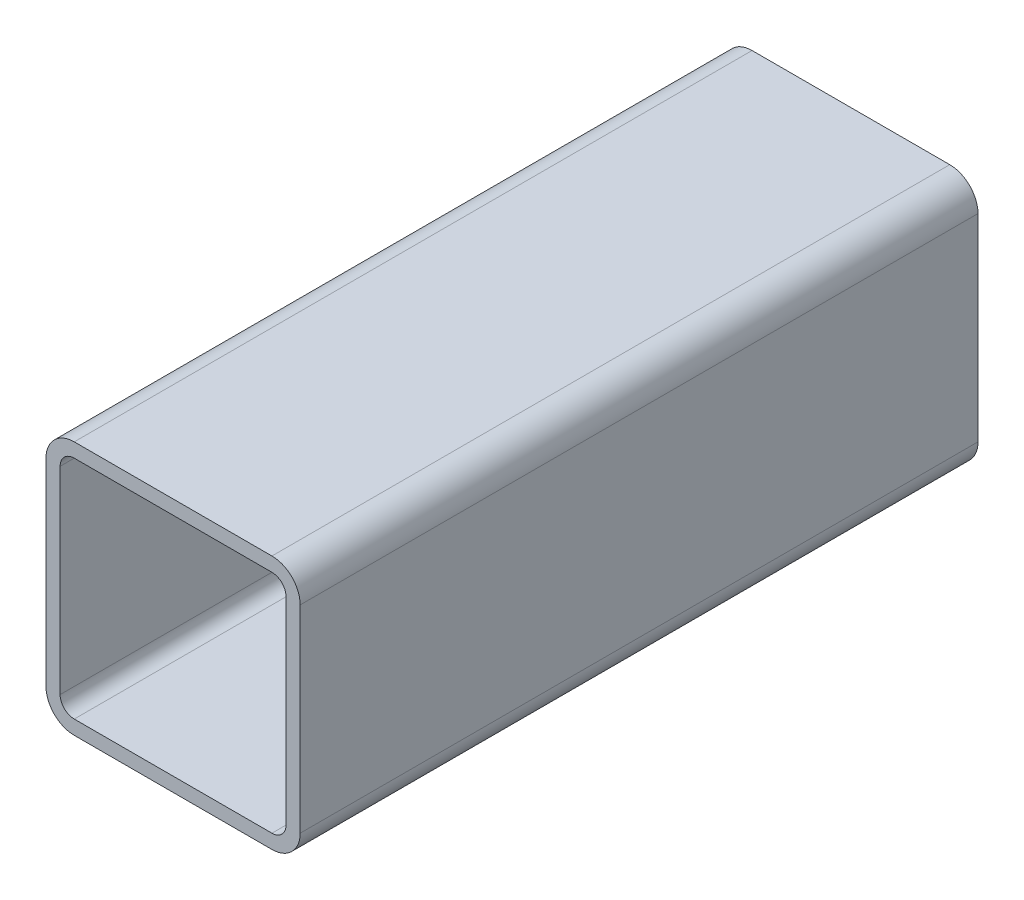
ISO-10303-21;
HEADER;
FILE_DESCRIPTION(('STEP AP214'),'2;1');
FILE_NAME('part.step','',(''),(''),'','','');
FILE_SCHEMA(('AUTOMOTIVE_DESIGN { 1 0 10303 214 1 1 1 1 }'));
ENDSEC;
DATA;
#1=APPLICATION_CONTEXT('core data for automotive mechanical design processes');
#2=APPLICATION_PROTOCOL_DEFINITION('international standard','automotive_design',2000,#1);
#3=PRODUCT_CONTEXT('',#1,'mechanical');
#4=PRODUCT('Part','Part','',(#3));
#5=PRODUCT_RELATED_PRODUCT_CATEGORY('part','',(#4));
#6=PRODUCT_DEFINITION_FORMATION('','',#4);
#7=PRODUCT_DEFINITION_CONTEXT('part definition',#1,'design');
#8=PRODUCT_DEFINITION('design','',#6,#7);
#9=PRODUCT_DEFINITION_SHAPE('','',#8);
#10=(LENGTH_UNIT() NAMED_UNIT(*) SI_UNIT(.MILLI.,.METRE.));
#11=(NAMED_UNIT(*) PLANE_ANGLE_UNIT() SI_UNIT($,.RADIAN.));
#12=(NAMED_UNIT(*) SI_UNIT($,.STERADIAN.) SOLID_ANGLE_UNIT());
#13=UNCERTAINTY_MEASURE_WITH_UNIT(LENGTH_MEASURE(1.E-05),#10,'distance_accuracy_value','');
#14=(GEOMETRIC_REPRESENTATION_CONTEXT(3) GLOBAL_UNCERTAINTY_ASSIGNED_CONTEXT((#13)) GLOBAL_UNIT_ASSIGNED_CONTEXT((#10,
#11,#12)) REPRESENTATION_CONTEXT('',''));
#15=CARTESIAN_POINT('',(0.,0.,0.));
#16=DIRECTION('',(0.,0.,1.));
#17=DIRECTION('',(1.,0.,0.));
#18=AXIS2_PLACEMENT_3D('',#15,#16,#17);
#19=CARTESIAN_POINT('',(13.9682087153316,102.378601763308,304.8));
#20=DIRECTION('',(0.,0.,1.));
#21=DIRECTION('',(1.,0.,0.));
#22=AXIS2_PLACEMENT_3D('',#19,#20,#21);
#23=PLANE('',#22);
#24=CARTESIAN_POINT('',(13.9682087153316,102.378601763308,304.8));
#25=DIRECTION('',(0.,0.,1.));
#26=DIRECTION('',(1.,0.,0.));
#27=AXIS2_PLACEMENT_3D('',#24,#25,#26);
#28=CIRCLE('',#27,12.7);
#29=CARTESIAN_POINT('',(13.9682087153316,115.078601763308,304.8));
#30=VERTEX_POINT('',#29);
#31=CARTESIAN_POINT('',(1.26820871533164,102.378601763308,304.8));
#32=VERTEX_POINT('',#31);
#33=EDGE_CURVE('E211',#30,#32,#28,.T.);
#34=ORIENTED_EDGE('',*,*,#33,.T.);
#35=DIRECTION('',(0.,-1.,0.));
#36=VECTOR('',#35,1.);
#37=CARTESIAN_POINT('',(1.26820871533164,13.4786017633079,304.8));
#38=LINE('',#37,#36);
#39=CARTESIAN_POINT('',(1.26820871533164,13.4786017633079,304.8));
#40=VERTEX_POINT('',#39);
#41=EDGE_CURVE('E214',#32,#40,#38,.T.);
#42=ORIENTED_EDGE('',*,*,#41,.T.);
#43=CARTESIAN_POINT('',(13.9682087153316,13.4786017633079,304.8));
#44=DIRECTION('',(0.,0.,1.));
#45=DIRECTION('',(1.,0.,0.));
#46=AXIS2_PLACEMENT_3D('',#43,#44,#45);
#47=CIRCLE('',#46,12.7);
#48=CARTESIAN_POINT('',(13.9682087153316,0.77860176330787,304.8));
#49=VERTEX_POINT('',#48);
#50=EDGE_CURVE('E217',#40,#49,#47,.T.);
#51=ORIENTED_EDGE('',*,*,#50,.T.);
#52=DIRECTION('',(1.,0.,0.));
#53=VECTOR('',#52,1.);
#54=CARTESIAN_POINT('',(102.868208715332,0.77860176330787,304.8));
#55=LINE('',#54,#53);
#56=CARTESIAN_POINT('',(102.868208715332,0.778601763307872,304.8));
#57=VERTEX_POINT('',#56);
#58=EDGE_CURVE('E219',#49,#57,#55,.T.);
#59=ORIENTED_EDGE('',*,*,#58,.T.);
#60=CARTESIAN_POINT('',(102.868208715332,13.4786017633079,304.8));
#61=DIRECTION('',(0.,0.,1.));
#62=DIRECTION('',(1.,0.,0.));
#63=AXIS2_PLACEMENT_3D('',#60,#61,#62);
#64=CIRCLE('',#63,12.7);
#65=CARTESIAN_POINT('',(115.568208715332,13.4786017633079,304.8));
#66=VERTEX_POINT('',#65);
#67=EDGE_CURVE('E221',#57,#66,#64,.T.);
#68=ORIENTED_EDGE('',*,*,#67,.T.);
#69=DIRECTION('',(0.,1.,0.));
#70=VECTOR('',#69,1.);
#71=CARTESIAN_POINT('',(115.568208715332,102.378601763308,304.8));
#72=LINE('',#71,#70);
#73=CARTESIAN_POINT('',(115.568208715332,102.378601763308,304.8));
#74=VERTEX_POINT('',#73);
#75=EDGE_CURVE('E223',#66,#74,#72,.T.);
#76=ORIENTED_EDGE('',*,*,#75,.T.);
#77=CARTESIAN_POINT('',(102.868208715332,102.378601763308,304.8));
#78=DIRECTION('',(0.,0.,1.));
#79=DIRECTION('',(1.,0.,0.));
#80=AXIS2_PLACEMENT_3D('',#77,#78,#79);
#81=CIRCLE('',#80,12.7);
#82=CARTESIAN_POINT('',(102.868208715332,115.078601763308,304.8));
#83=VERTEX_POINT('',#82);
#84=EDGE_CURVE('E225',#74,#83,#81,.T.);
#85=ORIENTED_EDGE('',*,*,#84,.T.);
#86=DIRECTION('',(-1.,0.,0.));
#87=VECTOR('',#86,1.);
#88=CARTESIAN_POINT('',(13.9682087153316,115.078601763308,304.8));
#89=LINE('',#88,#87);
#90=EDGE_CURVE('E227',#83,#30,#89,.T.);
#91=ORIENTED_EDGE('',*,*,#90,.T.);
#92=EDGE_LOOP('',(#34,#42,#51,#59,#68,#76,#85,#91));
#93=FACE_BOUND('',#92,.T.);
#94=DIRECTION('',(0.,-1.,0.));
#95=VECTOR('',#94,1.);
#96=CARTESIAN_POINT('',(7.61820871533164,13.4786017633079,304.8));
#97=LINE('',#96,#95);
#98=CARTESIAN_POINT('',(7.61820871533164,102.378601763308,304.8));
#99=VERTEX_POINT('',#98);
#100=CARTESIAN_POINT('',(7.61820871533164,13.4786017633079,304.8));
#101=VERTEX_POINT('',#100);
#102=EDGE_CURVE('E154',#99,#101,#97,.T.);
#103=ORIENTED_EDGE('',*,*,#102,.F.);
#104=CARTESIAN_POINT('',(13.9682087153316,102.378601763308,304.8));
#105=DIRECTION('',(0.,0.,1.));
#106=DIRECTION('',(1.,0.,0.));
#107=AXIS2_PLACEMENT_3D('',#104,#105,#106);
#108=CIRCLE('',#107,6.35000000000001);
#109=CARTESIAN_POINT('',(13.9682087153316,108.728601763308,304.8));
#110=VERTEX_POINT('',#109);
#111=EDGE_CURVE('E146',#110,#99,#108,.T.);
#112=ORIENTED_EDGE('',*,*,#111,.F.);
#113=DIRECTION('',(-1.,0.,0.));
#114=VECTOR('',#113,1.);
#115=CARTESIAN_POINT('',(13.9682087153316,108.728601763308,304.8));
#116=LINE('',#115,#114);
#117=CARTESIAN_POINT('',(102.868208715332,108.728601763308,304.8));
#118=VERTEX_POINT('',#117);
#119=EDGE_CURVE('E179',#118,#110,#116,.T.);
#120=ORIENTED_EDGE('',*,*,#119,.F.);
#121=CARTESIAN_POINT('',(102.868208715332,102.378601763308,304.8));
#122=DIRECTION('',(0.,0.,1.));
#123=DIRECTION('',(1.,0.,0.));
#124=AXIS2_PLACEMENT_3D('',#121,#122,#123);
#125=CIRCLE('',#124,6.35000000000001);
#126=CARTESIAN_POINT('',(109.218208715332,102.378601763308,304.8));
#127=VERTEX_POINT('',#126);
#128=EDGE_CURVE('E177',#127,#118,#125,.T.);
#129=ORIENTED_EDGE('',*,*,#128,.F.);
#130=DIRECTION('',(0.,1.,0.));
#131=VECTOR('',#130,1.);
#132=CARTESIAN_POINT('',(109.218208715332,102.378601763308,304.8));
#133=LINE('',#132,#131);
#134=CARTESIAN_POINT('',(109.218208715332,13.4786017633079,304.8));
#135=VERTEX_POINT('',#134);
#136=EDGE_CURVE('E175',#135,#127,#133,.T.);
#137=ORIENTED_EDGE('',*,*,#136,.F.);
#138=CARTESIAN_POINT('',(102.868208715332,13.4786017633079,304.8));
#139=DIRECTION('',(0.,0.,1.));
#140=DIRECTION('',(1.,0.,0.));
#141=AXIS2_PLACEMENT_3D('',#138,#139,#140);
#142=CIRCLE('',#141,6.35);
#143=CARTESIAN_POINT('',(102.868208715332,7.12860176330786,304.8));
#144=VERTEX_POINT('',#143);
#145=EDGE_CURVE('E173',#144,#135,#142,.T.);
#146=ORIENTED_EDGE('',*,*,#145,.F.);
#147=DIRECTION('',(1.,0.,0.));
#148=VECTOR('',#147,1.);
#149=CARTESIAN_POINT('',(102.868208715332,7.12860176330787,304.8));
#150=LINE('',#149,#148);
#151=CARTESIAN_POINT('',(13.9682087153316,7.12860176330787,304.8));
#152=VERTEX_POINT('',#151);
#153=EDGE_CURVE('E169',#152,#144,#150,.T.);
#154=ORIENTED_EDGE('',*,*,#153,.F.);
#155=CARTESIAN_POINT('',(13.9682087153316,13.4786017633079,304.8));
#156=DIRECTION('',(0.,0.,1.));
#157=DIRECTION('',(1.,0.,0.));
#158=AXIS2_PLACEMENT_3D('',#155,#156,#157);
#159=CIRCLE('',#158,6.35);
#160=EDGE_CURVE('E167',#101,#152,#159,.T.);
#161=ORIENTED_EDGE('',*,*,#160,.F.);
#162=EDGE_LOOP('',(#103,#112,#120,#129,#137,#146,#154,#161));
#163=FACE_BOUND('',#162,.T.);
#164=ADVANCED_FACE('F33',(#93,#163),#23,.T.);
#165=CARTESIAN_POINT('',(13.9682087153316,102.378601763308,0.));
#166=DIRECTION('',(0.,0.,1.));
#167=DIRECTION('',(1.,0.,0.));
#168=AXIS2_PLACEMENT_3D('',#165,#166,#167);
#169=PLANE('',#168);
#170=CARTESIAN_POINT('',(13.9682087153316,102.378601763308,0.));
#171=DIRECTION('',(0.,0.,1.));
#172=DIRECTION('',(1.,0.,0.));
#173=AXIS2_PLACEMENT_3D('',#170,#171,#172);
#174=CIRCLE('',#173,12.7);
#175=CARTESIAN_POINT('',(13.9682087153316,115.078601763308,0.));
#176=VERTEX_POINT('',#175);
#177=CARTESIAN_POINT('',(1.26820871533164,102.378601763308,0.));
#178=VERTEX_POINT('',#177);
#179=EDGE_CURVE('E162',#176,#178,#174,.T.);
#180=ORIENTED_EDGE('',*,*,#179,.F.);
#181=DIRECTION('',(-1.,0.,0.));
#182=VECTOR('',#181,1.);
#183=CARTESIAN_POINT('',(13.9682087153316,115.078601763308,0.));
#184=LINE('',#183,#182);
#185=CARTESIAN_POINT('',(102.868208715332,115.078601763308,0.));
#186=VERTEX_POINT('',#185);
#187=EDGE_CURVE('E215',#186,#176,#184,.T.);
#188=ORIENTED_EDGE('',*,*,#187,.F.);
#189=CARTESIAN_POINT('',(102.868208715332,102.378601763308,0.));
#190=DIRECTION('',(0.,0.,1.));
#191=DIRECTION('',(1.,0.,0.));
#192=AXIS2_PLACEMENT_3D('',#189,#190,#191);
#193=CIRCLE('',#192,12.7);
#194=CARTESIAN_POINT('',(115.568208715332,102.378601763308,0.));
#195=VERTEX_POINT('',#194);
#196=EDGE_CURVE('E242',#195,#186,#193,.T.);
#197=ORIENTED_EDGE('',*,*,#196,.F.);
#198=DIRECTION('',(0.,1.,0.));
#199=VECTOR('',#198,1.);
#200=CARTESIAN_POINT('',(115.568208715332,102.378601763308,0.));
#201=LINE('',#200,#199);
#202=CARTESIAN_POINT('',(115.568208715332,13.4786017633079,0.));
#203=VERTEX_POINT('',#202);
#204=EDGE_CURVE('E240',#203,#195,#201,.T.);
#205=ORIENTED_EDGE('',*,*,#204,.F.);
#206=CARTESIAN_POINT('',(102.868208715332,13.4786017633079,0.));
#207=DIRECTION('',(0.,0.,1.));
#208=DIRECTION('',(1.,0.,0.));
#209=AXIS2_PLACEMENT_3D('',#206,#207,#208);
#210=CIRCLE('',#209,12.7);
#211=CARTESIAN_POINT('',(102.868208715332,0.778601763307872,0.));
#212=VERTEX_POINT('',#211);
#213=EDGE_CURVE('E238',#212,#203,#210,.T.);
#214=ORIENTED_EDGE('',*,*,#213,.F.);
#215=DIRECTION('',(1.,0.,0.));
#216=VECTOR('',#215,1.);
#217=CARTESIAN_POINT('',(102.868208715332,0.77860176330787,0.));
#218=LINE('',#217,#216);
#219=CARTESIAN_POINT('',(13.9682087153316,0.77860176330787,0.));
#220=VERTEX_POINT('',#219);
#221=EDGE_CURVE('E236',#220,#212,#218,.T.);
#222=ORIENTED_EDGE('',*,*,#221,.F.);
#223=CARTESIAN_POINT('',(13.9682087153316,13.4786017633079,0.));
#224=DIRECTION('',(0.,0.,1.));
#225=DIRECTION('',(1.,0.,0.));
#226=AXIS2_PLACEMENT_3D('',#223,#224,#225);
#227=CIRCLE('',#226,12.7);
#228=CARTESIAN_POINT('',(1.26820871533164,13.4786017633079,0.));
#229=VERTEX_POINT('',#228);
#230=EDGE_CURVE('E234',#229,#220,#227,.T.);
#231=ORIENTED_EDGE('',*,*,#230,.F.);
#232=DIRECTION('',(0.,-1.,0.));
#233=VECTOR('',#232,1.);
#234=CARTESIAN_POINT('',(1.26820871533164,13.4786017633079,0.));
#235=LINE('',#234,#233);
#236=EDGE_CURVE('E232',#178,#229,#235,.T.);
#237=ORIENTED_EDGE('',*,*,#236,.F.);
#238=EDGE_LOOP('',(#180,#188,#197,#205,#214,#222,#231,#237));
#239=FACE_BOUND('',#238,.T.);
#240=CARTESIAN_POINT('',(13.9682087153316,102.378601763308,0.));
#241=DIRECTION('',(0.,0.,1.));
#242=DIRECTION('',(1.,0.,0.));
#243=AXIS2_PLACEMENT_3D('',#240,#241,#242);
#244=CIRCLE('',#243,6.35000000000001);
#245=CARTESIAN_POINT('',(13.9682087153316,108.728601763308,0.));
#246=VERTEX_POINT('',#245);
#247=CARTESIAN_POINT('',(7.61820871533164,102.378601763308,0.));
#248=VERTEX_POINT('',#247);
#249=EDGE_CURVE('E56',#246,#248,#244,.T.);
#250=ORIENTED_EDGE('',*,*,#249,.T.);
#251=DIRECTION('',(0.,-1.,0.));
#252=VECTOR('',#251,1.);
#253=CARTESIAN_POINT('',(7.61820871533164,13.4786017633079,0.));
#254=LINE('',#253,#252);
#255=CARTESIAN_POINT('',(7.61820871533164,13.4786017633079,0.));
#256=VERTEX_POINT('',#255);
#257=EDGE_CURVE('E161',#248,#256,#254,.T.);
#258=ORIENTED_EDGE('',*,*,#257,.T.);
#259=CARTESIAN_POINT('',(13.9682087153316,13.4786017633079,0.));
#260=DIRECTION('',(0.,0.,1.));
#261=DIRECTION('',(1.,0.,0.));
#262=AXIS2_PLACEMENT_3D('',#259,#260,#261);
#263=CIRCLE('',#262,6.35);
#264=CARTESIAN_POINT('',(13.9682087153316,7.12860176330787,0.));
#265=VERTEX_POINT('',#264);
#266=EDGE_CURVE('E183',#256,#265,#263,.T.);
#267=ORIENTED_EDGE('',*,*,#266,.T.);
#268=DIRECTION('',(1.,0.,0.));
#269=VECTOR('',#268,1.);
#270=CARTESIAN_POINT('',(102.868208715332,7.12860176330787,0.));
#271=LINE('',#270,#269);
#272=CARTESIAN_POINT('',(102.868208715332,7.12860176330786,0.));
#273=VERTEX_POINT('',#272);
#274=EDGE_CURVE('E186',#265,#273,#271,.T.);
#275=ORIENTED_EDGE('',*,*,#274,.T.);
#276=CARTESIAN_POINT('',(102.868208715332,13.4786017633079,0.));
#277=DIRECTION('',(0.,0.,1.));
#278=DIRECTION('',(1.,0.,0.));
#279=AXIS2_PLACEMENT_3D('',#276,#277,#278);
#280=CIRCLE('',#279,6.35);
#281=CARTESIAN_POINT('',(109.218208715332,13.4786017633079,0.));
#282=VERTEX_POINT('',#281);
#283=EDGE_CURVE('E189',#273,#282,#280,.T.);
#284=ORIENTED_EDGE('',*,*,#283,.T.);
#285=DIRECTION('',(0.,1.,0.));
#286=VECTOR('',#285,1.);
#287=CARTESIAN_POINT('',(109.218208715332,102.378601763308,0.));
#288=LINE('',#287,#286);
#289=CARTESIAN_POINT('',(109.218208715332,102.378601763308,0.));
#290=VERTEX_POINT('',#289);
#291=EDGE_CURVE('E192',#282,#290,#288,.T.);
#292=ORIENTED_EDGE('',*,*,#291,.T.);
#293=CARTESIAN_POINT('',(102.868208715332,102.378601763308,0.));
#294=DIRECTION('',(0.,0.,1.));
#295=DIRECTION('',(1.,0.,0.));
#296=AXIS2_PLACEMENT_3D('',#293,#294,#295);
#297=CIRCLE('',#296,6.35000000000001);
#298=CARTESIAN_POINT('',(102.868208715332,108.728601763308,0.));
#299=VERTEX_POINT('',#298);
#300=EDGE_CURVE('E195',#290,#299,#297,.T.);
#301=ORIENTED_EDGE('',*,*,#300,.T.);
#302=DIRECTION('',(-1.,0.,0.));
#303=VECTOR('',#302,1.);
#304=CARTESIAN_POINT('',(13.9682087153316,108.728601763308,0.));
#305=LINE('',#304,#303);
#306=EDGE_CURVE('E155',#299,#246,#305,.T.);
#307=ORIENTED_EDGE('',*,*,#306,.T.);
#308=EDGE_LOOP('',(#250,#258,#267,#275,#284,#292,#301,#307));
#309=FACE_BOUND('',#308,.T.);
#310=ADVANCED_FACE('F272',(#239,#309),#169,.F.);
#311=CARTESIAN_POINT('',(13.9682087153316,102.378601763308,304.8));
#312=DIRECTION('',(0.,0.,-1.));
#313=DIRECTION('',(-1.,0.,0.));
#314=AXIS2_PLACEMENT_3D('',#311,#312,#313);
#315=CYLINDRICAL_SURFACE('',#314,12.7);
#316=ORIENTED_EDGE('',*,*,#179,.T.);
#317=DIRECTION('',(0.,0.,-1.));
#318=VECTOR('',#317,1.);
#319=CARTESIAN_POINT('',(1.26820871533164,102.378601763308,304.8));
#320=LINE('',#319,#318);
#321=EDGE_CURVE('E11',#32,#178,#320,.T.);
#322=ORIENTED_EDGE('',*,*,#321,.F.);
#323=ORIENTED_EDGE('',*,*,#33,.F.);
#324=DIRECTION('',(0.,0.,-1.));
#325=VECTOR('',#324,1.);
#326=CARTESIAN_POINT('',(13.9682087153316,115.078601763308,304.8));
#327=LINE('',#326,#325);
#328=EDGE_CURVE('E229',#30,#176,#327,.T.);
#329=ORIENTED_EDGE('',*,*,#328,.T.);
#330=EDGE_LOOP('',(#316,#322,#323,#329));
#331=FACE_BOUND('',#330,.T.);
#332=ADVANCED_FACE('F35',(#331),#315,.T.);
#333=CARTESIAN_POINT('',(1.26820871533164,13.4786017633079,304.8));
#334=DIRECTION('',(1.,0.,0.));
#335=DIRECTION('',(0.,0.,-1.));
#336=AXIS2_PLACEMENT_3D('',#333,#334,#335);
#337=PLANE('',#336);
#338=ORIENTED_EDGE('',*,*,#236,.T.);
#339=DIRECTION('',(0.,0.,-1.));
#340=VECTOR('',#339,1.);
#341=CARTESIAN_POINT('',(1.26820871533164,13.4786017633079,304.8));
#342=LINE('',#341,#340);
#343=EDGE_CURVE('E41',#40,#229,#342,.T.);
#344=ORIENTED_EDGE('',*,*,#343,.F.);
#345=ORIENTED_EDGE('',*,*,#41,.F.);
#346=ORIENTED_EDGE('',*,*,#321,.T.);
#347=EDGE_LOOP('',(#338,#344,#345,#346));
#348=FACE_BOUND('',#347,.T.);
#349=ADVANCED_FACE('F289',(#348),#337,.F.);
#350=CARTESIAN_POINT('',(13.9682087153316,13.4786017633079,304.8));
#351=DIRECTION('',(0.,0.,-1.));
#352=DIRECTION('',(-1.,0.,0.));
#353=AXIS2_PLACEMENT_3D('',#350,#351,#352);
#354=CYLINDRICAL_SURFACE('',#353,12.7);
#355=ORIENTED_EDGE('',*,*,#230,.T.);
#356=DIRECTION('',(0.,0.,-1.));
#357=VECTOR('',#356,1.);
#358=CARTESIAN_POINT('',(13.9682087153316,0.77860176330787,304.8));
#359=LINE('',#358,#357);
#360=EDGE_CURVE('E259',#49,#220,#359,.T.);
#361=ORIENTED_EDGE('',*,*,#360,.F.);
#362=ORIENTED_EDGE('',*,*,#50,.F.);
#363=ORIENTED_EDGE('',*,*,#343,.T.);
#364=EDGE_LOOP('',(#355,#361,#362,#363));
#365=FACE_BOUND('',#364,.T.);
#366=ADVANCED_FACE('F266',(#365),#354,.T.);
#367=CARTESIAN_POINT('',(102.868208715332,0.77860176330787,304.8));
#368=DIRECTION('',(0.,1.,0.));
#369=DIRECTION('',(0.,0.,1.));
#370=AXIS2_PLACEMENT_3D('',#367,#368,#369);
#371=PLANE('',#370);
#372=ORIENTED_EDGE('',*,*,#221,.T.);
#373=DIRECTION('',(0.,0.,-1.));
#374=VECTOR('',#373,1.);
#375=CARTESIAN_POINT('',(102.868208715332,0.778601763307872,304.8));
#376=LINE('',#375,#374);
#377=EDGE_CURVE('E256',#57,#212,#376,.T.);
#378=ORIENTED_EDGE('',*,*,#377,.F.);
#379=ORIENTED_EDGE('',*,*,#58,.F.);
#380=ORIENTED_EDGE('',*,*,#360,.T.);
#381=EDGE_LOOP('',(#372,#378,#379,#380));
#382=FACE_BOUND('',#381,.T.);
#383=ADVANCED_FACE('F278',(#382),#371,.F.);
#384=CARTESIAN_POINT('',(102.868208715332,13.4786017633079,304.8));
#385=DIRECTION('',(0.,0.,-1.));
#386=DIRECTION('',(-1.,0.,0.));
#387=AXIS2_PLACEMENT_3D('',#384,#385,#386);
#388=CYLINDRICAL_SURFACE('',#387,12.7);
#389=ORIENTED_EDGE('',*,*,#213,.T.);
#390=DIRECTION('',(0.,0.,-1.));
#391=VECTOR('',#390,1.);
#392=CARTESIAN_POINT('',(115.568208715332,13.4786017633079,304.8));
#393=LINE('',#392,#391);
#394=EDGE_CURVE('E253',#66,#203,#393,.T.);
#395=ORIENTED_EDGE('',*,*,#394,.F.);
#396=ORIENTED_EDGE('',*,*,#67,.F.);
#397=ORIENTED_EDGE('',*,*,#377,.T.);
#398=EDGE_LOOP('',(#389,#395,#396,#397));
#399=FACE_BOUND('',#398,.T.);
#400=ADVANCED_FACE('F282',(#399),#388,.T.);
#401=CARTESIAN_POINT('',(115.568208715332,102.378601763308,304.8));
#402=DIRECTION('',(-1.,0.,0.));
#403=DIRECTION('',(0.,0.,1.));
#404=AXIS2_PLACEMENT_3D('',#401,#402,#403);
#405=PLANE('',#404);
#406=ORIENTED_EDGE('',*,*,#204,.T.);
#407=DIRECTION('',(0.,0.,-1.));
#408=VECTOR('',#407,1.);
#409=CARTESIAN_POINT('',(115.568208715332,102.378601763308,304.8));
#410=LINE('',#409,#408);
#411=EDGE_CURVE('E250',#74,#195,#410,.T.);
#412=ORIENTED_EDGE('',*,*,#411,.F.);
#413=ORIENTED_EDGE('',*,*,#75,.F.);
#414=ORIENTED_EDGE('',*,*,#394,.T.);
#415=EDGE_LOOP('',(#406,#412,#413,#414));
#416=FACE_BOUND('',#415,.T.);
#417=ADVANCED_FACE('F302',(#416),#405,.F.);
#418=CARTESIAN_POINT('',(102.868208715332,102.378601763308,304.8));
#419=DIRECTION('',(0.,0.,-1.));
#420=DIRECTION('',(-1.,0.,0.));
#421=AXIS2_PLACEMENT_3D('',#418,#419,#420);
#422=CYLINDRICAL_SURFACE('',#421,12.7);
#423=ORIENTED_EDGE('',*,*,#196,.T.);
#424=DIRECTION('',(0.,0.,-1.));
#425=VECTOR('',#424,1.);
#426=CARTESIAN_POINT('',(102.868208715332,115.078601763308,304.8));
#427=LINE('',#426,#425);
#428=EDGE_CURVE('E247',#83,#186,#427,.T.);
#429=ORIENTED_EDGE('',*,*,#428,.F.);
#430=ORIENTED_EDGE('',*,*,#84,.F.);
#431=ORIENTED_EDGE('',*,*,#411,.T.);
#432=EDGE_LOOP('',(#423,#429,#430,#431));
#433=FACE_BOUND('',#432,.T.);
#434=ADVANCED_FACE('F300',(#433),#422,.T.);
#435=CARTESIAN_POINT('',(13.9682087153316,115.078601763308,304.8));
#436=DIRECTION('',(0.,-1.,0.));
#437=DIRECTION('',(0.,0.,-1.));
#438=AXIS2_PLACEMENT_3D('',#435,#436,#437);
#439=PLANE('',#438);
#440=ORIENTED_EDGE('',*,*,#187,.T.);
#441=ORIENTED_EDGE('',*,*,#328,.F.);
#442=ORIENTED_EDGE('',*,*,#90,.F.);
#443=ORIENTED_EDGE('',*,*,#428,.T.);
#444=EDGE_LOOP('',(#440,#441,#442,#443));
#445=FACE_BOUND('',#444,.T.);
#446=ADVANCED_FACE('F295',(#445),#439,.F.);
#447=CARTESIAN_POINT('',(13.9682087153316,102.378601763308,304.8));
#448=DIRECTION('',(0.,0.,-1.));
#449=DIRECTION('',(-1.,0.,0.));
#450=AXIS2_PLACEMENT_3D('',#447,#448,#449);
#451=CYLINDRICAL_SURFACE('',#450,6.35000000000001);
#452=ORIENTED_EDGE('',*,*,#249,.F.);
#453=DIRECTION('',(0.,0.,-1.));
#454=VECTOR('',#453,1.);
#455=CARTESIAN_POINT('',(13.9682087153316,108.728601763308,304.8));
#456=LINE('',#455,#454);
#457=EDGE_CURVE('E150',#110,#246,#456,.T.);
#458=ORIENTED_EDGE('',*,*,#457,.F.);
#459=ORIENTED_EDGE('',*,*,#111,.T.);
#460=DIRECTION('',(0.,0.,-1.));
#461=VECTOR('',#460,1.);
#462=CARTESIAN_POINT('',(7.61820871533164,102.378601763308,304.8));
#463=LINE('',#462,#461);
#464=EDGE_CURVE('E149',#99,#248,#463,.T.);
#465=ORIENTED_EDGE('',*,*,#464,.T.);
#466=EDGE_LOOP('',(#452,#458,#459,#465));
#467=FACE_BOUND('',#466,.T.);
#468=ADVANCED_FACE('F148',(#467),#451,.F.);
#469=CARTESIAN_POINT('',(7.61820871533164,13.4786017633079,304.8));
#470=DIRECTION('',(1.,0.,0.));
#471=DIRECTION('',(0.,0.,-1.));
#472=AXIS2_PLACEMENT_3D('',#469,#470,#471);
#473=PLANE('',#472);
#474=ORIENTED_EDGE('',*,*,#257,.F.);
#475=ORIENTED_EDGE('',*,*,#464,.F.);
#476=ORIENTED_EDGE('',*,*,#102,.T.);
#477=DIRECTION('',(0.,0.,-1.));
#478=VECTOR('',#477,1.);
#479=CARTESIAN_POINT('',(7.61820871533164,13.4786017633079,304.8));
#480=LINE('',#479,#478);
#481=EDGE_CURVE('E163',#101,#256,#480,.T.);
#482=ORIENTED_EDGE('',*,*,#481,.T.);
#483=EDGE_LOOP('',(#474,#475,#476,#482));
#484=FACE_BOUND('',#483,.T.);
#485=ADVANCED_FACE('F158',(#484),#473,.T.);
#486=CARTESIAN_POINT('',(13.9682087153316,13.4786017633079,304.8));
#487=DIRECTION('',(0.,0.,-1.));
#488=DIRECTION('',(-1.,0.,0.));
#489=AXIS2_PLACEMENT_3D('',#486,#487,#488);
#490=CYLINDRICAL_SURFACE('',#489,6.35);
#491=ORIENTED_EDGE('',*,*,#266,.F.);
#492=ORIENTED_EDGE('',*,*,#481,.F.);
#493=ORIENTED_EDGE('',*,*,#160,.T.);
#494=DIRECTION('',(0.,0.,-1.));
#495=VECTOR('',#494,1.);
#496=CARTESIAN_POINT('',(13.9682087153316,7.12860176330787,304.8));
#497=LINE('',#496,#495);
#498=EDGE_CURVE('E208',#152,#265,#497,.T.);
#499=ORIENTED_EDGE('',*,*,#498,.T.);
#500=EDGE_LOOP('',(#491,#492,#493,#499));
#501=FACE_BOUND('',#500,.T.);
#502=ADVANCED_FACE('F327',(#501),#490,.F.);
#503=CARTESIAN_POINT('',(102.868208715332,7.12860176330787,304.8));
#504=DIRECTION('',(0.,1.,0.));
#505=DIRECTION('',(0.,0.,1.));
#506=AXIS2_PLACEMENT_3D('',#503,#504,#505);
#507=PLANE('',#506);
#508=ORIENTED_EDGE('',*,*,#274,.F.);
#509=ORIENTED_EDGE('',*,*,#498,.F.);
#510=ORIENTED_EDGE('',*,*,#153,.T.);
#511=DIRECTION('',(0.,0.,-1.));
#512=VECTOR('',#511,1.);
#513=CARTESIAN_POINT('',(102.868208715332,7.12860176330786,304.8));
#514=LINE('',#513,#512);
#515=EDGE_CURVE('E206',#144,#273,#514,.T.);
#516=ORIENTED_EDGE('',*,*,#515,.T.);
#517=EDGE_LOOP('',(#508,#509,#510,#516));
#518=FACE_BOUND('',#517,.T.);
#519=ADVANCED_FACE('F331',(#518),#507,.T.);
#520=CARTESIAN_POINT('',(102.868208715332,13.4786017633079,304.8));
#521=DIRECTION('',(0.,0.,-1.));
#522=DIRECTION('',(-1.,0.,0.));
#523=AXIS2_PLACEMENT_3D('',#520,#521,#522);
#524=CYLINDRICAL_SURFACE('',#523,6.35);
#525=ORIENTED_EDGE('',*,*,#283,.F.);
#526=ORIENTED_EDGE('',*,*,#515,.F.);
#527=ORIENTED_EDGE('',*,*,#145,.T.);
#528=DIRECTION('',(0.,0.,-1.));
#529=VECTOR('',#528,1.);
#530=CARTESIAN_POINT('',(109.218208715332,13.4786017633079,304.8));
#531=LINE('',#530,#529);
#532=EDGE_CURVE('E204',#135,#282,#531,.T.);
#533=ORIENTED_EDGE('',*,*,#532,.T.);
#534=EDGE_LOOP('',(#525,#526,#527,#533));
#535=FACE_BOUND('',#534,.T.);
#536=ADVANCED_FACE('F337',(#535),#524,.F.);
#537=CARTESIAN_POINT('',(109.218208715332,102.378601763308,304.8));
#538=DIRECTION('',(-1.,0.,0.));
#539=DIRECTION('',(0.,0.,1.));
#540=AXIS2_PLACEMENT_3D('',#537,#538,#539);
#541=PLANE('',#540);
#542=ORIENTED_EDGE('',*,*,#291,.F.);
#543=ORIENTED_EDGE('',*,*,#532,.F.);
#544=ORIENTED_EDGE('',*,*,#136,.T.);
#545=DIRECTION('',(0.,0.,-1.));
#546=VECTOR('',#545,1.);
#547=CARTESIAN_POINT('',(109.218208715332,102.378601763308,304.8));
#548=LINE('',#547,#546);
#549=EDGE_CURVE('E202',#127,#290,#548,.T.);
#550=ORIENTED_EDGE('',*,*,#549,.T.);
#551=EDGE_LOOP('',(#542,#543,#544,#550));
#552=FACE_BOUND('',#551,.T.);
#553=ADVANCED_FACE('F341',(#552),#541,.T.);
#554=CARTESIAN_POINT('',(102.868208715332,102.378601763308,304.8));
#555=DIRECTION('',(0.,0.,-1.));
#556=DIRECTION('',(-1.,0.,0.));
#557=AXIS2_PLACEMENT_3D('',#554,#555,#556);
#558=CYLINDRICAL_SURFACE('',#557,6.35000000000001);
#559=ORIENTED_EDGE('',*,*,#300,.F.);
#560=ORIENTED_EDGE('',*,*,#549,.F.);
#561=ORIENTED_EDGE('',*,*,#128,.T.);
#562=DIRECTION('',(0.,0.,-1.));
#563=VECTOR('',#562,1.);
#564=CARTESIAN_POINT('',(102.868208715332,108.728601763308,304.8));
#565=LINE('',#564,#563);
#566=EDGE_CURVE('E48',#118,#299,#565,.T.);
#567=ORIENTED_EDGE('',*,*,#566,.T.);
#568=EDGE_LOOP('',(#559,#560,#561,#567));
#569=FACE_BOUND('',#568,.T.);
#570=ADVANCED_FACE('F345',(#569),#558,.F.);
#571=CARTESIAN_POINT('',(13.9682087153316,108.728601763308,304.8));
#572=DIRECTION('',(0.,-1.,0.));
#573=DIRECTION('',(0.,0.,-1.));
#574=AXIS2_PLACEMENT_3D('',#571,#572,#573);
#575=PLANE('',#574);
#576=ORIENTED_EDGE('',*,*,#306,.F.);
#577=ORIENTED_EDGE('',*,*,#566,.F.);
#578=ORIENTED_EDGE('',*,*,#119,.T.);
#579=ORIENTED_EDGE('',*,*,#457,.T.);
#580=EDGE_LOOP('',(#576,#577,#578,#579));
#581=FACE_BOUND('',#580,.T.);
#582=ADVANCED_FACE('F349',(#581),#575,.T.);
#583=CLOSED_SHELL('',(#164,#310,#332,#349,#366,#383,#400,#417,#434,#446,#468,#485,#502,#519,
#536,#553,#570,#582));
#584=MANIFOLD_SOLID_BREP('B2',#583);
#585=ADVANCED_BREP_SHAPE_REPRESENTATION('',(#18,#584),#14);
#586=SHAPE_DEFINITION_REPRESENTATION(#9,#585);
ENDSEC;
END-ISO-10303-21;
